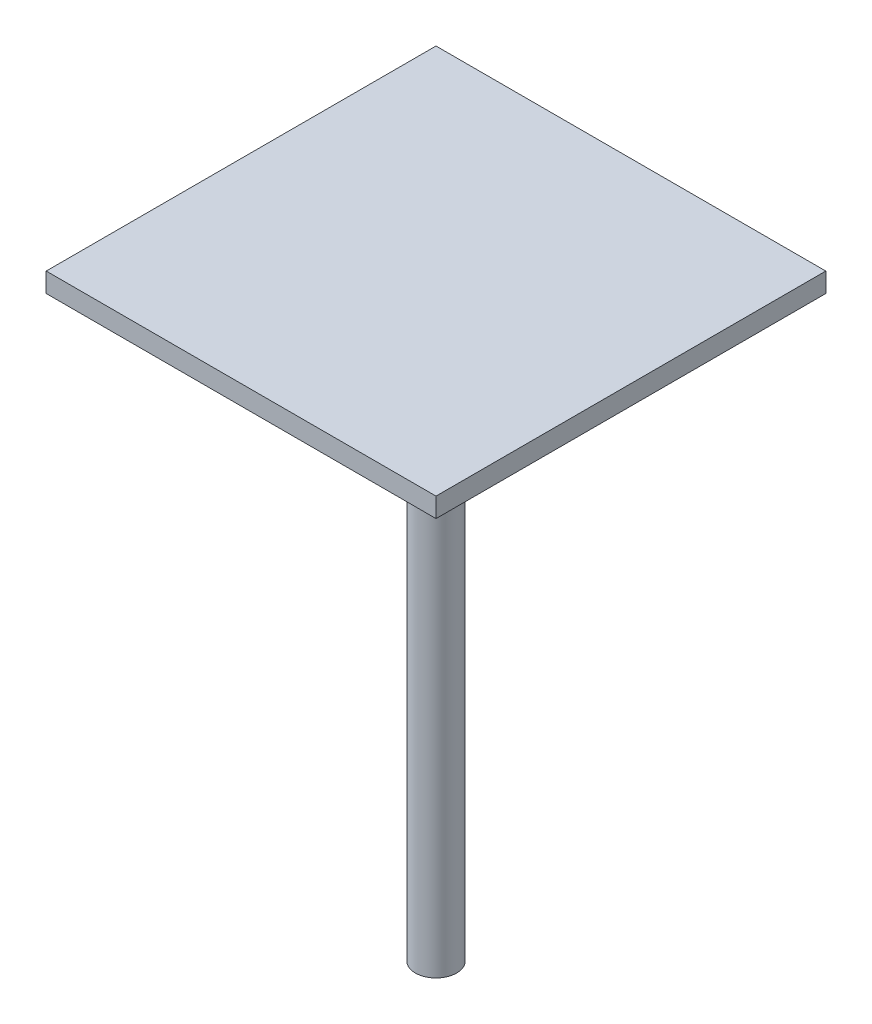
from build123d import *

# Parameters (mm, degrees)
SKETCH1_W        = 60
SKETCH1_H        = 60
SKETCH1_R        = 3.175
BASE_DEPTH       = 3
SKETCH1_3_R      = 3.175
SINGLEAXLE_DEPTH = 89


with BuildPart() as part:
    # Sketch1 → base (new body)
    # profile 1 of 2: a face of its own
    with BuildSketch(Plane(origin=(0, 0, 0), x_dir=(1, 0, 0), z_dir=(0, 1, 0))):
        Rectangle(SKETCH1_W, SKETCH1_H)
        Circle(SKETCH1_R, mode=Mode.SUBTRACT)
    # profile 2 of 2: a face of its own
    with BuildSketch(Plane(origin=(0, 0, 0), x_dir=(1, 0, 0), z_dir=(0, 1, 0))):
        Circle(SKETCH1_R)
    extrude(amount=BASE_DEPTH)

    # Sketch1_3 → SingleAxle (add)
    with BuildSketch(Plane(origin=(0, 0, 0), x_dir=(1, 0, 0), z_dir=(0, 1, 0))):
        with Locations(Location((0, 0, 0), (0, 0, 270))):
            Circle(SKETCH1_3_R)
    extrude(amount=-SINGLEAXLE_DEPTH)


solid = part.part
